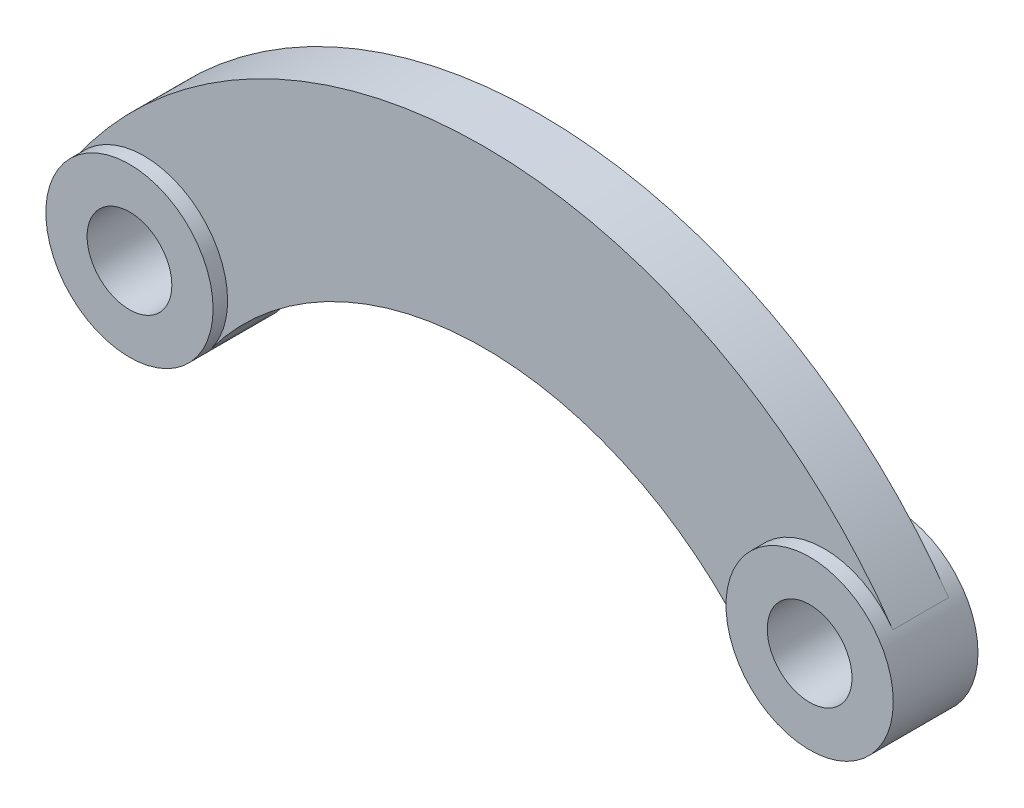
ISO-10303-21;
HEADER;
FILE_DESCRIPTION(('STEP AP214'),'2;1');
FILE_NAME('part.step','',(''),(''),'','','');
FILE_SCHEMA(('AUTOMOTIVE_DESIGN { 1 0 10303 214 1 1 1 1 }'));
ENDSEC;
DATA;
#1=APPLICATION_CONTEXT('core data for automotive mechanical design processes');
#2=APPLICATION_PROTOCOL_DEFINITION('international standard','automotive_design',2000,#1);
#3=PRODUCT_CONTEXT('',#1,'mechanical');
#4=PRODUCT('Part','Part','',(#3));
#5=PRODUCT_RELATED_PRODUCT_CATEGORY('part','',(#4));
#6=PRODUCT_DEFINITION_FORMATION('','',#4);
#7=PRODUCT_DEFINITION_CONTEXT('part definition',#1,'design');
#8=PRODUCT_DEFINITION('design','',#6,#7);
#9=PRODUCT_DEFINITION_SHAPE('','',#8);
#10=(LENGTH_UNIT() NAMED_UNIT(*) SI_UNIT(.MILLI.,.METRE.));
#11=(NAMED_UNIT(*) PLANE_ANGLE_UNIT() SI_UNIT($,.RADIAN.));
#12=(NAMED_UNIT(*) SI_UNIT($,.STERADIAN.) SOLID_ANGLE_UNIT());
#13=UNCERTAINTY_MEASURE_WITH_UNIT(LENGTH_MEASURE(1.E-05),#10,'distance_accuracy_value','');
#14=(GEOMETRIC_REPRESENTATION_CONTEXT(3) GLOBAL_UNCERTAINTY_ASSIGNED_CONTEXT((#13)) GLOBAL_UNIT_ASSIGNED_CONTEXT((#10,
#11,#12)) REPRESENTATION_CONTEXT('',''));
#15=CARTESIAN_POINT('',(0.,0.,0.));
#16=DIRECTION('',(0.,0.,1.));
#17=DIRECTION('',(1.,0.,0.));
#18=AXIS2_PLACEMENT_3D('',#15,#16,#17);
#19=CARTESIAN_POINT('',(0.,-226.660539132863,25.));
#20=DIRECTION('',(0.,0.,-1.));
#21=DIRECTION('',(-1.,0.,0.));
#22=AXIS2_PLACEMENT_3D('',#19,#20,#21);
#23=CYLINDRICAL_SURFACE('',#22,305.);
#24=CARTESIAN_POINT('',(0.,-226.660539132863,-25.));
#25=DIRECTION('',(0.,0.,1.));
#26=DIRECTION('',(1.,0.,0.));
#27=AXIS2_PLACEMENT_3D('',#24,#25,#26);
#28=CIRCLE('',#27,305.);
#29=CARTESIAN_POINT('',(-244.802631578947,-44.7356327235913,-25.));
#30=VERTEX_POINT('',#29);
#31=CARTESIAN_POINT('',(244.802631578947,-44.7356327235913,-25.));
#32=VERTEX_POINT('',#31);
#33=EDGE_CURVE('E82',#30,#32,#28,.F.);
#34=ORIENTED_EDGE('',*,*,#33,.T.);
#35=DIRECTION('',(0.,0.,-1.));
#36=VECTOR('',#35,1.);
#37=CARTESIAN_POINT('',(244.802631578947,-44.7356327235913,25.));
#38=LINE('',#37,#36);
#39=CARTESIAN_POINT('',(244.802631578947,-44.7356327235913,25.));
#40=VERTEX_POINT('',#39);
#41=EDGE_CURVE('E42',#40,#32,#38,.T.);
#42=ORIENTED_EDGE('',*,*,#41,.F.);
#43=CARTESIAN_POINT('',(0.,-226.660539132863,25.));
#44=DIRECTION('',(0.,0.,1.));
#45=DIRECTION('',(1.,0.,0.));
#46=AXIS2_PLACEMENT_3D('',#43,#44,#45);
#47=CIRCLE('',#46,305.);
#48=CARTESIAN_POINT('',(-244.802631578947,-44.7356327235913,25.));
#49=VERTEX_POINT('',#48);
#50=EDGE_CURVE('E95',#49,#40,#47,.F.);
#51=ORIENTED_EDGE('',*,*,#50,.F.);
#52=DIRECTION('',(0.,0.,-1.));
#53=VECTOR('',#52,1.);
#54=CARTESIAN_POINT('',(-244.802631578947,-44.7356327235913,25.));
#55=LINE('',#54,#53);
#56=EDGE_CURVE('E11',#49,#30,#55,.T.);
#57=ORIENTED_EDGE('',*,*,#56,.T.);
#58=EDGE_LOOP('',(#34,#42,#51,#57));
#59=FACE_BOUND('',#58,.T.);
#60=ADVANCED_FACE('F35',(#59),#23,.F.);
#61=CARTESIAN_POINT('',(0.,-211.224998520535,25.));
#62=DIRECTION('',(0.,0.,-1.));
#63=DIRECTION('',(-1.,0.,0.));
#64=AXIS2_PLACEMENT_3D('',#61,#62,#63);
#65=CYLINDRICAL_SURFACE('',#64,446.);
#66=CARTESIAN_POINT('',(0.,-211.224998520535,-25.));
#67=DIRECTION('',(0.,0.,1.));
#68=DIRECTION('',(1.,0.,0.));
#69=AXIS2_PLACEMENT_3D('',#66,#67,#68);
#70=CIRCLE('',#69,446.);
#71=CARTESIAN_POINT('',(-366.657681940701,42.70047139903,-25.));
#72=VERTEX_POINT('',#71);
#73=CARTESIAN_POINT('',(366.657681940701,42.70047139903,-25.));
#74=VERTEX_POINT('',#73);
#75=EDGE_CURVE('E81',#72,#74,#70,.F.);
#76=ORIENTED_EDGE('',*,*,#75,.F.);
#77=DIRECTION('',(0.,0.,-1.));
#78=VECTOR('',#77,1.);
#79=CARTESIAN_POINT('',(-366.657681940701,42.70047139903,25.));
#80=LINE('',#79,#78);
#81=CARTESIAN_POINT('',(-366.657681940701,42.70047139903,25.));
#82=VERTEX_POINT('',#81);
#83=EDGE_CURVE('E49',#82,#72,#80,.T.);
#84=ORIENTED_EDGE('',*,*,#83,.F.);
#85=CARTESIAN_POINT('',(0.,-211.224998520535,25.));
#86=DIRECTION('',(0.,0.,1.));
#87=DIRECTION('',(1.,0.,0.));
#88=AXIS2_PLACEMENT_3D('',#85,#86,#87);
#89=CIRCLE('',#88,446.);
#90=CARTESIAN_POINT('',(366.657681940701,42.7004713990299,25.));
#91=VERTEX_POINT('',#90);
#92=EDGE_CURVE('E89',#82,#91,#89,.F.);
#93=ORIENTED_EDGE('',*,*,#92,.T.);
#94=DIRECTION('',(0.,0.,-1.));
#95=VECTOR('',#94,1.);
#96=CARTESIAN_POINT('',(366.657681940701,42.70047139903,25.));
#97=LINE('',#96,#95);
#98=EDGE_CURVE('E76',#91,#74,#97,.T.);
#99=ORIENTED_EDGE('',*,*,#98,.T.);
#100=EDGE_LOOP('',(#76,#84,#93,#99));
#101=FACE_BOUND('',#100,.T.);
#102=ADVANCED_FACE('F87',(#101),#65,.T.);
#103=CARTESIAN_POINT('',(0.,0.,25.));
#104=DIRECTION('',(0.,0.,1.));
#105=DIRECTION('',(1.,0.,0.));
#106=AXIS2_PLACEMENT_3D('',#103,#104,#105);
#107=PLANE('',#106);
#108=CARTESIAN_POINT('',(-305.,0.,25.));
#109=DIRECTION('',(0.,0.,1.));
#110=DIRECTION('',(1.,0.,0.));
#111=AXIS2_PLACEMENT_3D('',#108,#109,#110);
#112=CIRCLE('',#111,75.);
#113=EDGE_CURVE('E93',#49,#82,#112,.T.);
#114=ORIENTED_EDGE('',*,*,#113,.F.);
#115=ORIENTED_EDGE('',*,*,#50,.T.);
#116=CARTESIAN_POINT('',(305.,0.,25.));
#117=DIRECTION('',(0.,0.,1.));
#118=DIRECTION('',(1.,0.,0.));
#119=AXIS2_PLACEMENT_3D('',#116,#117,#118);
#120=CIRCLE('',#119,75.);
#121=EDGE_CURVE('E99',#91,#40,#120,.T.);
#122=ORIENTED_EDGE('',*,*,#121,.F.);
#123=ORIENTED_EDGE('',*,*,#92,.F.);
#124=EDGE_LOOP('',(#114,#115,#122,#123));
#125=FACE_BOUND('',#124,.T.);
#126=ADVANCED_FACE('F112',(#125),#107,.T.);
#127=CARTESIAN_POINT('',(0.,0.,-25.));
#128=DIRECTION('',(0.,0.,1.));
#129=DIRECTION('',(1.,0.,0.));
#130=AXIS2_PLACEMENT_3D('',#127,#128,#129);
#131=PLANE('',#130);
#132=CARTESIAN_POINT('',(-305.,0.,-25.));
#133=DIRECTION('',(0.,0.,1.));
#134=DIRECTION('',(1.,0.,0.));
#135=AXIS2_PLACEMENT_3D('',#132,#133,#134);
#136=CIRCLE('',#135,75.);
#137=EDGE_CURVE('E92',#30,#72,#136,.T.);
#138=ORIENTED_EDGE('',*,*,#137,.T.);
#139=ORIENTED_EDGE('',*,*,#75,.T.);
#140=CARTESIAN_POINT('',(305.,0.,-25.));
#141=DIRECTION('',(0.,0.,1.));
#142=DIRECTION('',(1.,0.,0.));
#143=AXIS2_PLACEMENT_3D('',#140,#141,#142);
#144=CIRCLE('',#143,75.);
#145=EDGE_CURVE('E72',#74,#32,#144,.T.);
#146=ORIENTED_EDGE('',*,*,#145,.T.);
#147=ORIENTED_EDGE('',*,*,#33,.F.);
#148=EDGE_LOOP('',(#138,#139,#146,#147));
#149=FACE_BOUND('',#148,.T.);
#150=ADVANCED_FACE('F91',(#149),#131,.F.);
#151=CARTESIAN_POINT('',(-305.,0.,38.));
#152=DIRECTION('',(0.,0.,-1.));
#153=DIRECTION('',(-1.,0.,0.));
#154=AXIS2_PLACEMENT_3D('',#151,#152,#153);
#155=CYLINDRICAL_SURFACE('',#154,75.);
#156=ORIENTED_EDGE('',*,*,#113,.T.);
#157=ORIENTED_EDGE('',*,*,#83,.T.);
#158=ORIENTED_EDGE('',*,*,#137,.F.);
#159=ORIENTED_EDGE('',*,*,#56,.F.);
#160=EDGE_LOOP('',(#156,#157,#158,#159));
#161=FACE_BOUND('',#160,.T.);
#162=CARTESIAN_POINT('',(-305.,0.,38.));
#163=DIRECTION('',(0.,0.,1.));
#164=DIRECTION('',(1.,0.,0.));
#165=AXIS2_PLACEMENT_3D('',#162,#163,#164);
#166=CIRCLE('',#165,75.);
#167=CARTESIAN_POINT('',(-230.,0.,38.));
#168=VERTEX_POINT('',#167);
#169=EDGE_CURVE('E104',#168,#168,#166,.T.);
#170=ORIENTED_EDGE('',*,*,#169,.F.);
#171=EDGE_LOOP('',(#170));
#172=FACE_BOUND('',#171,.T.);
#173=CARTESIAN_POINT('',(-305.,0.,-38.));
#174=DIRECTION('',(0.,0.,1.));
#175=DIRECTION('',(1.,0.,0.));
#176=AXIS2_PLACEMENT_3D('',#173,#174,#175);
#177=CIRCLE('',#176,75.);
#178=CARTESIAN_POINT('',(-230.,0.,-38.));
#179=VERTEX_POINT('',#178);
#180=EDGE_CURVE('E114',#179,#179,#177,.T.);
#181=ORIENTED_EDGE('',*,*,#180,.T.);
#182=EDGE_LOOP('',(#181));
#183=FACE_BOUND('',#182,.T.);
#184=ADVANCED_FACE('F109',(#161,#172,#183),#155,.T.);
#185=CARTESIAN_POINT('',(0.,0.,38.));
#186=DIRECTION('',(0.,0.,1.));
#187=DIRECTION('',(1.,0.,0.));
#188=AXIS2_PLACEMENT_3D('',#185,#186,#187);
#189=PLANE('',#188);
#190=CARTESIAN_POINT('',(-305.,0.,38.));
#191=DIRECTION('',(0.,0.,1.));
#192=DIRECTION('',(1.,0.,0.));
#193=AXIS2_PLACEMENT_3D('',#190,#191,#192);
#194=CIRCLE('',#193,38.);
#195=CARTESIAN_POINT('',(-267.,0.,38.));
#196=VERTEX_POINT('',#195);
#197=EDGE_CURVE('E132',#196,#196,#194,.T.);
#198=ORIENTED_EDGE('',*,*,#197,.F.);
#199=EDGE_LOOP('',(#198));
#200=FACE_BOUND('',#199,.T.);
#201=ORIENTED_EDGE('',*,*,#169,.T.);
#202=EDGE_LOOP('',(#201));
#203=FACE_BOUND('',#202,.T.);
#204=ADVANCED_FACE('F148',(#200,#203),#189,.T.);
#205=CARTESIAN_POINT('',(0.,0.,-38.));
#206=DIRECTION('',(0.,0.,1.));
#207=DIRECTION('',(1.,0.,0.));
#208=AXIS2_PLACEMENT_3D('',#205,#206,#207);
#209=PLANE('',#208);
#210=CARTESIAN_POINT('',(-305.,0.,-38.));
#211=DIRECTION('',(0.,0.,1.));
#212=DIRECTION('',(1.,0.,0.));
#213=AXIS2_PLACEMENT_3D('',#210,#211,#212);
#214=CIRCLE('',#213,38.);
#215=CARTESIAN_POINT('',(-267.,0.,-38.));
#216=VERTEX_POINT('',#215);
#217=EDGE_CURVE('E123',#216,#216,#214,.T.);
#218=ORIENTED_EDGE('',*,*,#217,.T.);
#219=EDGE_LOOP('',(#218));
#220=FACE_BOUND('',#219,.T.);
#221=ORIENTED_EDGE('',*,*,#180,.F.);
#222=EDGE_LOOP('',(#221));
#223=FACE_BOUND('',#222,.T.);
#224=ADVANCED_FACE('F138',(#220,#223),#209,.F.);
#225=CARTESIAN_POINT('',(305.,0.,38.));
#226=DIRECTION('',(0.,0.,-1.));
#227=DIRECTION('',(-1.,0.,0.));
#228=AXIS2_PLACEMENT_3D('',#225,#226,#227);
#229=CYLINDRICAL_SURFACE('',#228,75.);
#230=ORIENTED_EDGE('',*,*,#121,.T.);
#231=ORIENTED_EDGE('',*,*,#41,.T.);
#232=ORIENTED_EDGE('',*,*,#145,.F.);
#233=ORIENTED_EDGE('',*,*,#98,.F.);
#234=EDGE_LOOP('',(#230,#231,#232,#233));
#235=FACE_BOUND('',#234,.T.);
#236=CARTESIAN_POINT('',(305.,0.,38.));
#237=DIRECTION('',(0.,0.,1.));
#238=DIRECTION('',(1.,0.,0.));
#239=AXIS2_PLACEMENT_3D('',#236,#237,#238);
#240=CIRCLE('',#239,75.);
#241=CARTESIAN_POINT('',(380.,0.,38.));
#242=VERTEX_POINT('',#241);
#243=EDGE_CURVE('E117',#242,#242,#240,.T.);
#244=ORIENTED_EDGE('',*,*,#243,.F.);
#245=EDGE_LOOP('',(#244));
#246=FACE_BOUND('',#245,.T.);
#247=CARTESIAN_POINT('',(305.,0.,-38.));
#248=DIRECTION('',(0.,0.,1.));
#249=DIRECTION('',(1.,0.,0.));
#250=AXIS2_PLACEMENT_3D('',#247,#248,#249);
#251=CIRCLE('',#250,75.);
#252=CARTESIAN_POINT('',(380.,0.,-38.));
#253=VERTEX_POINT('',#252);
#254=EDGE_CURVE('E120',#253,#253,#251,.T.);
#255=ORIENTED_EDGE('',*,*,#254,.T.);
#256=EDGE_LOOP('',(#255));
#257=FACE_BOUND('',#256,.T.);
#258=ADVANCED_FACE('F74',(#235,#246,#257),#229,.T.);
#259=CARTESIAN_POINT('',(0.,0.,38.));
#260=DIRECTION('',(0.,0.,1.));
#261=DIRECTION('',(1.,0.,0.));
#262=AXIS2_PLACEMENT_3D('',#259,#260,#261);
#263=PLANE('',#262);
#264=CARTESIAN_POINT('',(305.,0.,38.));
#265=DIRECTION('',(0.,0.,1.));
#266=DIRECTION('',(1.,0.,0.));
#267=AXIS2_PLACEMENT_3D('',#264,#265,#266);
#268=CIRCLE('',#267,38.);
#269=CARTESIAN_POINT('',(343.,0.,38.));
#270=VERTEX_POINT('',#269);
#271=EDGE_CURVE('E126',#270,#270,#268,.T.);
#272=ORIENTED_EDGE('',*,*,#271,.F.);
#273=EDGE_LOOP('',(#272));
#274=FACE_BOUND('',#273,.T.);
#275=ORIENTED_EDGE('',*,*,#243,.T.);
#276=EDGE_LOOP('',(#275));
#277=FACE_BOUND('',#276,.T.);
#278=ADVANCED_FACE('F163',(#274,#277),#263,.T.);
#279=CARTESIAN_POINT('',(0.,0.,-38.));
#280=DIRECTION('',(0.,0.,1.));
#281=DIRECTION('',(1.,0.,0.));
#282=AXIS2_PLACEMENT_3D('',#279,#280,#281);
#283=PLANE('',#282);
#284=CARTESIAN_POINT('',(305.,0.,-38.));
#285=DIRECTION('',(0.,0.,1.));
#286=DIRECTION('',(1.,0.,0.));
#287=AXIS2_PLACEMENT_3D('',#284,#285,#286);
#288=CIRCLE('',#287,38.);
#289=CARTESIAN_POINT('',(343.,0.,-38.));
#290=VERTEX_POINT('',#289);
#291=EDGE_CURVE('E129',#290,#290,#288,.T.);
#292=ORIENTED_EDGE('',*,*,#291,.T.);
#293=EDGE_LOOP('',(#292));
#294=FACE_BOUND('',#293,.T.);
#295=ORIENTED_EDGE('',*,*,#254,.F.);
#296=EDGE_LOOP('',(#295));
#297=FACE_BOUND('',#296,.T.);
#298=ADVANCED_FACE('F203',(#294,#297),#283,.F.);
#299=CARTESIAN_POINT('',(305.,0.,-38.));
#300=DIRECTION('',(0.,0.,1.));
#301=DIRECTION('',(1.,0.,0.));
#302=AXIS2_PLACEMENT_3D('',#299,#300,#301);
#303=CYLINDRICAL_SURFACE('',#302,38.);
#304=ORIENTED_EDGE('',*,*,#291,.F.);
#305=EDGE_LOOP('',(#304));
#306=FACE_BOUND('',#305,.T.);
#307=ORIENTED_EDGE('',*,*,#271,.T.);
#308=EDGE_LOOP('',(#307));
#309=FACE_BOUND('',#308,.T.);
#310=ADVANCED_FACE('F144',(#306,#309),#303,.F.);
#311=CARTESIAN_POINT('',(-305.,0.,-38.));
#312=DIRECTION('',(0.,0.,1.));
#313=DIRECTION('',(1.,0.,0.));
#314=AXIS2_PLACEMENT_3D('',#311,#312,#313);
#315=CYLINDRICAL_SURFACE('',#314,38.);
#316=ORIENTED_EDGE('',*,*,#217,.F.);
#317=EDGE_LOOP('',(#316));
#318=FACE_BOUND('',#317,.T.);
#319=ORIENTED_EDGE('',*,*,#197,.T.);
#320=EDGE_LOOP('',(#319));
#321=FACE_BOUND('',#320,.T.);
#322=ADVANCED_FACE('F141',(#318,#321),#315,.F.);
#323=CLOSED_SHELL('',(#60,#102,#126,#150,#184,#204,#224,#258,#278,#298,#310,#322));
#324=MANIFOLD_SOLID_BREP('B2',#323);
#325=ADVANCED_BREP_SHAPE_REPRESENTATION('',(#18,#324),#14);
#326=SHAPE_DEFINITION_REPRESENTATION(#9,#325);
ENDSEC;
END-ISO-10303-21;
